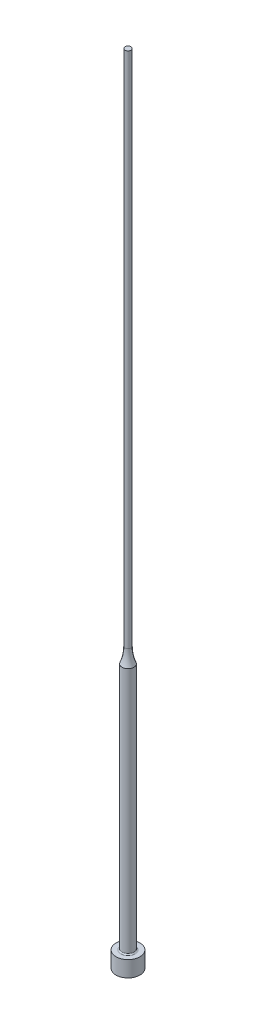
ISO-10303-21;
HEADER;
FILE_DESCRIPTION(('STEP AP214'),'2;1');
FILE_NAME('part.step','',(''),(''),'','','');
FILE_SCHEMA(('AUTOMOTIVE_DESIGN { 1 0 10303 214 1 1 1 1 }'));
ENDSEC;
DATA;
#1=APPLICATION_CONTEXT('core data for automotive mechanical design processes');
#2=APPLICATION_PROTOCOL_DEFINITION('international standard','automotive_design',2000,#1);
#3=PRODUCT_CONTEXT('',#1,'mechanical');
#4=PRODUCT('Part','Part','',(#3));
#5=PRODUCT_RELATED_PRODUCT_CATEGORY('part','',(#4));
#6=PRODUCT_DEFINITION_FORMATION('','',#4);
#7=PRODUCT_DEFINITION_CONTEXT('part definition',#1,'design');
#8=PRODUCT_DEFINITION('design','',#6,#7);
#9=PRODUCT_DEFINITION_SHAPE('','',#8);
#10=(LENGTH_UNIT() NAMED_UNIT(*) SI_UNIT(.MILLI.,.METRE.));
#11=(NAMED_UNIT(*) PLANE_ANGLE_UNIT() SI_UNIT($,.RADIAN.));
#12=(NAMED_UNIT(*) SI_UNIT($,.STERADIAN.) SOLID_ANGLE_UNIT());
#13=UNCERTAINTY_MEASURE_WITH_UNIT(LENGTH_MEASURE(1.E-05),#10,'distance_accuracy_value','');
#14=(GEOMETRIC_REPRESENTATION_CONTEXT(3) GLOBAL_UNCERTAINTY_ASSIGNED_CONTEXT((#13)) GLOBAL_UNIT_ASSIGNED_CONTEXT((#10,
#11,#12)) REPRESENTATION_CONTEXT('',''));
#15=CARTESIAN_POINT('',(0.,0.,0.));
#16=DIRECTION('',(0.,0.,1.));
#17=DIRECTION('',(1.,0.,0.));
#18=AXIS2_PLACEMENT_3D('',#15,#16,#17);
#19=CARTESIAN_POINT('',(0.750000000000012,200.,0.));
#20=DIRECTION('',(0.,-1.,0.));
#21=DIRECTION('',(1.,0.,0.));
#22=AXIS2_PLACEMENT_3D('',#19,#20,#21);
#23=PLANE('',#22);
#24=CARTESIAN_POINT('',(0.,200.,0.));
#25=DIRECTION('',(0.,1.,0.));
#26=DIRECTION('',(-1.,0.,0.));
#27=AXIS2_PLACEMENT_3D('',#24,#25,#26);
#28=CIRCLE('',#27,0.750000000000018);
#29=CARTESIAN_POINT('',(-0.750000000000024,200.,0.));
#30=VERTEX_POINT('',#29);
#31=EDGE_CURVE('E10',#30,#30,#28,.T.);
#32=ORIENTED_EDGE('',*,*,#31,.T.);
#33=EDGE_LOOP('',(#32));
#34=FACE_BOUND('',#33,.T.);
#35=ADVANCED_FACE('F30',(#34),#23,.F.);
#36=CARTESIAN_POINT('',(0.,200.,0.));
#37=DIRECTION('',(0.,1.,0.));
#38=DIRECTION('',(-1.,0.,0.));
#39=AXIS2_PLACEMENT_3D('',#36,#37,#38);
#40=CYLINDRICAL_SURFACE('',#39,0.750000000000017);
#41=ORIENTED_EDGE('',*,*,#31,.F.);
#42=EDGE_LOOP('',(#41));
#43=FACE_BOUND('',#42,.T.);
#44=CARTESIAN_POINT('',(0.,70.,0.));
#45=DIRECTION('',(0.,1.,0.));
#46=DIRECTION('',(-1.,0.,0.));
#47=AXIS2_PLACEMENT_3D('',#44,#45,#46);
#48=CIRCLE('',#47,0.750000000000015);
#49=CARTESIAN_POINT('',(-0.750000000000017,70.,0.));
#50=VERTEX_POINT('',#49);
#51=EDGE_CURVE('E36',#50,#50,#48,.T.);
#52=ORIENTED_EDGE('',*,*,#51,.T.);
#53=EDGE_LOOP('',(#52));
#54=FACE_BOUND('',#53,.T.);
#55=ADVANCED_FACE('F71',(#43,#54),#40,.T.);
#56=CARTESIAN_POINT('',(0.,70.,0.));
#57=DIRECTION('',(0.,1.,0.));
#58=DIRECTION('',(-1.,0.,0.));
#59=AXIS2_PLACEMENT_3D('',#56,#57,#58);
#60=TOROIDAL_SURFACE('',#59,10.75,10.);
#61=ORIENTED_EDGE('',*,*,#51,.F.);
#62=EDGE_LOOP('',(#61));
#63=FACE_BOUND('',#62,.T.);
#64=CARTESIAN_POINT('',(0.,66.2003289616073,0.));
#65=DIRECTION('',(0.,1.,0.));
#66=DIRECTION('',(-1.,0.,0.));
#67=AXIS2_PLACEMENT_3D('',#64,#65,#66);
#68=CIRCLE('',#67,1.50000000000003);
#69=CARTESIAN_POINT('',(-1.50000000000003,66.2003289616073,0.));
#70=VERTEX_POINT('',#69);
#71=EDGE_CURVE('E40',#70,#70,#68,.T.);
#72=ORIENTED_EDGE('',*,*,#71,.T.);
#73=EDGE_LOOP('',(#72));
#74=FACE_BOUND('',#73,.T.);
#75=ADVANCED_FACE('F75',(#63,#74),#60,.F.);
#76=CARTESIAN_POINT('',(0.,200.,0.));
#77=DIRECTION('',(0.,1.,0.));
#78=DIRECTION('',(-1.,0.,0.));
#79=AXIS2_PLACEMENT_3D('',#76,#77,#78);
#80=CYLINDRICAL_SURFACE('',#79,1.50000000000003);
#81=ORIENTED_EDGE('',*,*,#71,.F.);
#82=EDGE_LOOP('',(#81));
#83=FACE_BOUND('',#82,.T.);
#84=CARTESIAN_POINT('',(0.,4.3,0.));
#85=DIRECTION('',(0.,1.,0.));
#86=DIRECTION('',(-1.,0.,0.));
#87=AXIS2_PLACEMENT_3D('',#84,#85,#86);
#88=CIRCLE('',#87,1.50000000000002);
#89=CARTESIAN_POINT('',(-1.50000000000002,4.3,0.));
#90=VERTEX_POINT('',#89);
#91=EDGE_CURVE('E44',#90,#90,#88,.T.);
#92=ORIENTED_EDGE('',*,*,#91,.T.);
#93=EDGE_LOOP('',(#92));
#94=FACE_BOUND('',#93,.T.);
#95=ADVANCED_FACE('F80',(#83,#94),#80,.T.);
#96=CARTESIAN_POINT('',(0.,4.3,0.));
#97=DIRECTION('',(0.,1.,0.));
#98=DIRECTION('',(-1.,0.,0.));
#99=AXIS2_PLACEMENT_3D('',#96,#97,#98);
#100=TOROIDAL_SURFACE('',#99,1.80000000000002,0.3);
#101=ORIENTED_EDGE('',*,*,#91,.F.);
#102=EDGE_LOOP('',(#101));
#103=FACE_BOUND('',#102,.T.);
#104=CARTESIAN_POINT('',(0.,4.,0.));
#105=DIRECTION('',(0.,1.,0.));
#106=DIRECTION('',(-1.,0.,0.));
#107=AXIS2_PLACEMENT_3D('',#104,#105,#106);
#108=CIRCLE('',#107,1.80000000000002);
#109=CARTESIAN_POINT('',(-1.80000000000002,4.,0.));
#110=VERTEX_POINT('',#109);
#111=EDGE_CURVE('E49',#110,#110,#108,.T.);
#112=ORIENTED_EDGE('',*,*,#111,.T.);
#113=EDGE_LOOP('',(#112));
#114=FACE_BOUND('',#113,.T.);
#115=ADVANCED_FACE('F86',(#103,#114),#100,.F.);
#116=CARTESIAN_POINT('',(3.00000000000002,4.,0.));
#117=DIRECTION('',(0.,-1.,0.));
#118=DIRECTION('',(1.,0.,0.));
#119=AXIS2_PLACEMENT_3D('',#116,#117,#118);
#120=PLANE('',#119);
#121=ORIENTED_EDGE('',*,*,#111,.F.);
#122=EDGE_LOOP('',(#121));
#123=FACE_BOUND('',#122,.T.);
#124=CARTESIAN_POINT('',(0.,4.,0.));
#125=DIRECTION('',(0.,1.,0.));
#126=DIRECTION('',(-1.,0.,0.));
#127=AXIS2_PLACEMENT_3D('',#124,#125,#126);
#128=CIRCLE('',#127,3.00000000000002);
#129=CARTESIAN_POINT('',(-3.00000000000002,4.,0.));
#130=VERTEX_POINT('',#129);
#131=EDGE_CURVE('E52',#130,#130,#128,.T.);
#132=ORIENTED_EDGE('',*,*,#131,.T.);
#133=EDGE_LOOP('',(#132));
#134=FACE_BOUND('',#133,.T.);
#135=ADVANCED_FACE('F67',(#123,#134),#120,.F.);
#136=CARTESIAN_POINT('',(0.,200.,0.));
#137=DIRECTION('',(0.,1.,0.));
#138=DIRECTION('',(-1.,0.,0.));
#139=AXIS2_PLACEMENT_3D('',#136,#137,#138);
#140=CYLINDRICAL_SURFACE('',#139,3.00000000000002);
#141=ORIENTED_EDGE('',*,*,#131,.F.);
#142=EDGE_LOOP('',(#141));
#143=FACE_BOUND('',#142,.T.);
#144=CARTESIAN_POINT('',(0.,0.,0.));
#145=DIRECTION('',(0.,1.,0.));
#146=DIRECTION('',(-1.,0.,0.));
#147=AXIS2_PLACEMENT_3D('',#144,#145,#146);
#148=CIRCLE('',#147,3.00000000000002);
#149=CARTESIAN_POINT('',(-3.00000000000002,0.,0.));
#150=VERTEX_POINT('',#149);
#151=EDGE_CURVE('E55',#150,#150,#148,.T.);
#152=ORIENTED_EDGE('',*,*,#151,.T.);
#153=EDGE_LOOP('',(#152));
#154=FACE_BOUND('',#153,.T.);
#155=ADVANCED_FACE('F59',(#143,#154),#140,.T.);
#156=CARTESIAN_POINT('',(0.,0.,0.));
#157=DIRECTION('',(0.,1.,0.));
#158=DIRECTION('',(-1.,0.,0.));
#159=AXIS2_PLACEMENT_3D('',#156,#157,#158);
#160=PLANE('',#159);
#161=ORIENTED_EDGE('',*,*,#151,.F.);
#162=EDGE_LOOP('',(#161));
#163=FACE_BOUND('',#162,.T.);
#164=ADVANCED_FACE('F61',(#163),#160,.F.);
#165=CLOSED_SHELL('',(#35,#55,#75,#95,#115,#135,#155,#164));
#166=MANIFOLD_SOLID_BREP('B2',#165);
#167=ADVANCED_BREP_SHAPE_REPRESENTATION('',(#18,#166),#14);
#168=SHAPE_DEFINITION_REPRESENTATION(#9,#167);
ENDSEC;
END-ISO-10303-21;
